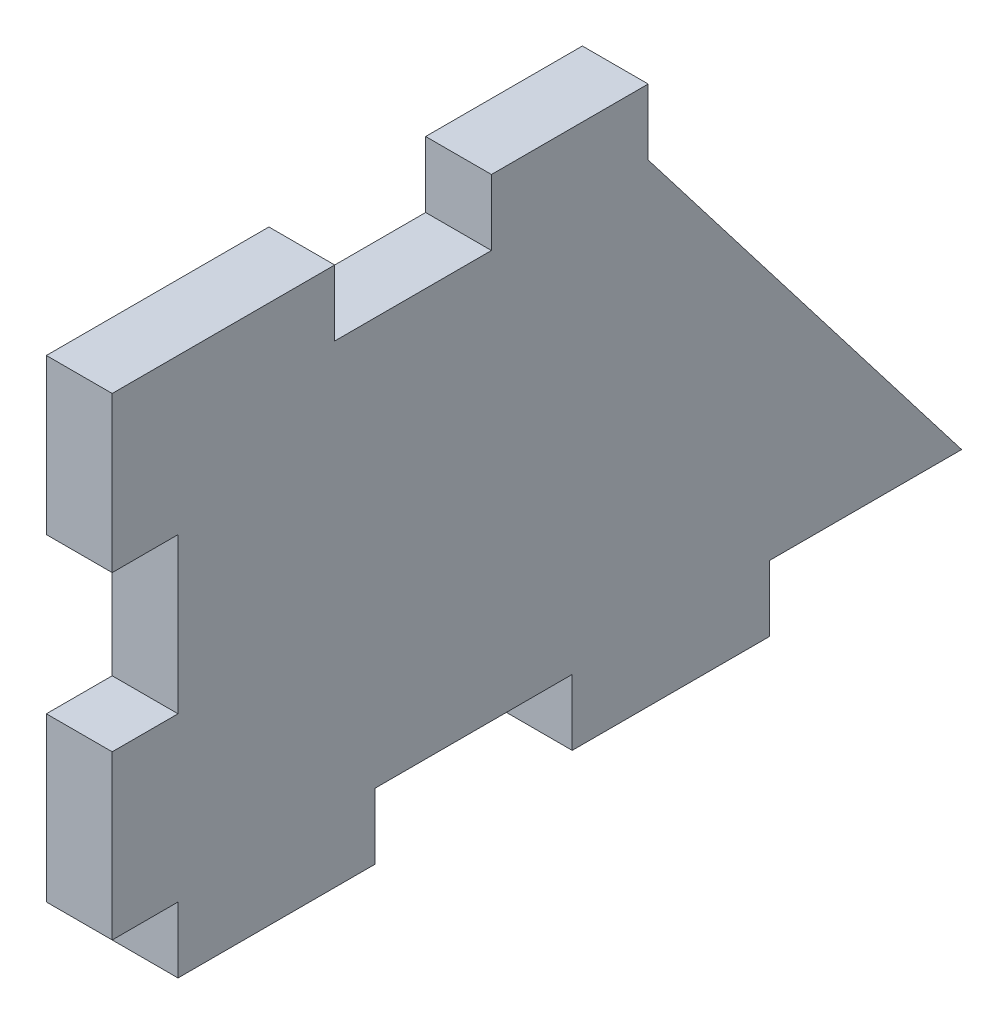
from build123d import *

# Parameters (mm, degrees)
SKETCH1_W            = 63.5
SKETCH1_H            = 33.02
BOSS_EXTRUDE1_DEPTH  = 5.334
CUT_EXTRUDE1_DEPTH   = 37.181406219
SKETCH3_W            = 12.7
SKETCH3_H            = 5.334
SKETCH3_W_2          = 15.971321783
BOSS_EXTRUDE2_DEPTH  = 5.334
SKETCH4_W            = 5.334
SKETCH4_H            = 37.084
BOSS_EXTRUDE7_DEPTH  = 5.334
SKETCH5_W            = 5.334
SKETCH5_H            = 12.573
CUT_EXTRUDE2_DEPTH   = 44.368594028
SKETCH6_W            = 5.334
SKETCH6_H            = 0.635
BOSS_EXTRUDE9_DEPTH  = 5.334
SKETCH7_W            = 5.334
SKETCH7_H            = 0.635
BOSS_EXTRUDE10_DEPTH = 5.334


with BuildPart() as part:
    # Sketch1 → Boss-Extrude1 (new body)
    with BuildSketch(Plane(origin=(0, 0, 0), x_dir=(0, 0, -1), z_dir=(1, 0, 0))):
        Rectangle(SKETCH1_W, SKETCH1_H)
    extrude(amount=BOSS_EXTRUDE1_DEPTH)

    # Sketch2 → Cut-Extrude1 (cut, through all)
    with BuildSketch(Plane.ZY):
        Polygon((-31.75, -16.51), (-31.75, 16.51), (-6.35, 16.51), align=None)
    extrude(amount=-CUT_EXTRUDE1_DEPTH, mode=Mode.SUBTRACT)

    # Sketch3 → Boss-Extrude2 (add, through all)
    with BuildSketch(Plane.ZY):
        with Locations((25.4, 19.177)):
            Rectangle(SKETCH3_W, SKETCH3_H)
        with Locations((0, 19.177)):
            Rectangle(SKETCH3_W, SKETCH3_H)
        with Locations((23.764339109, -19.177)):
            Rectangle(SKETCH3_W_2, SKETCH3_H)
        with Locations((-8.178304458, -19.177)):
            Rectangle(SKETCH3_W_2, SKETCH3_H)
    extrude(amount=-BOSS_EXTRUDE2_DEPTH)

    # Sketch4 → Boss-Extrude7 (add)
    with BuildSketch(Plane.ZY):
        with Locations((34.417, 2.667)):
            Rectangle(SKETCH4_W, SKETCH4_H)
    extrude(amount=-BOSS_EXTRUDE7_DEPTH)

    # Sketch5 → Cut-Extrude2 (cut, through all)
    with BuildSketch(Plane(origin=(5.334, 0, 0), x_dir=(0, 0, -1), z_dir=(1, 0, 0))):
        with Locations((-34.417, 2.9845)):
            Rectangle(SKETCH5_W, SKETCH5_H)
    extrude(amount=-CUT_EXTRUDE2_DEPTH, mode=Mode.SUBTRACT)

    # Sketch6 → Boss-Extrude9 (add)
    with BuildSketch(Plane(origin=(5.334, 0, 0), x_dir=(0, 0, -1), z_dir=(1, 0, 0))):
        with Locations((-34.417, 21.5265)):
            Rectangle(SKETCH6_W, SKETCH6_H)
    extrude(amount=-BOSS_EXTRUDE9_DEPTH)

    # Sketch7 → Boss-Extrude10 (add)
    with BuildSketch(Plane(origin=(5.334, 0, 0), x_dir=(0, 0, -1), z_dir=(1, 0, 0))):
        with Locations((-34.417, -16.1925)):
            Rectangle(SKETCH7_W, SKETCH7_H)
    extrude(amount=-BOSS_EXTRUDE10_DEPTH)


solid = part.part
